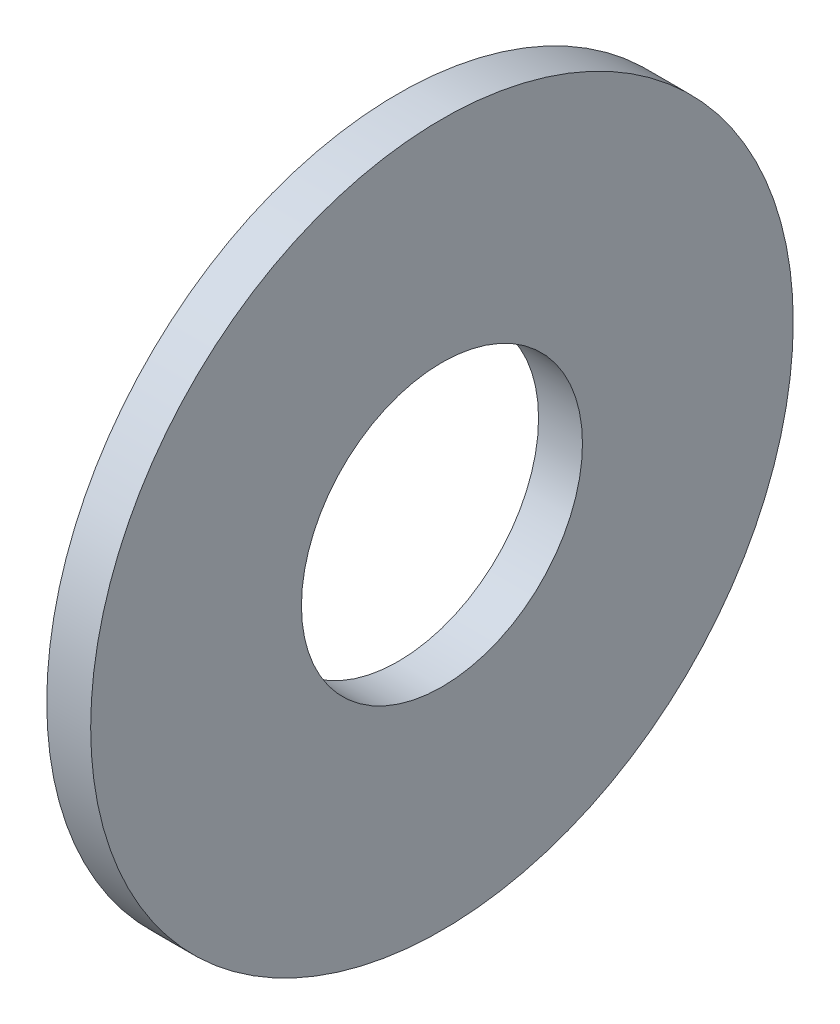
ISO-10303-21;
HEADER;
FILE_DESCRIPTION(('STEP AP214'),'2;1');
FILE_NAME('part.step','',(''),(''),'','','');
FILE_SCHEMA(('AUTOMOTIVE_DESIGN { 1 0 10303 214 1 1 1 1 }'));
ENDSEC;
DATA;
#1=APPLICATION_CONTEXT('core data for automotive mechanical design processes');
#2=APPLICATION_PROTOCOL_DEFINITION('international standard','automotive_design',2000,#1);
#3=PRODUCT_CONTEXT('',#1,'mechanical');
#4=PRODUCT('Part','Part','',(#3));
#5=PRODUCT_RELATED_PRODUCT_CATEGORY('part','',(#4));
#6=PRODUCT_DEFINITION_FORMATION('','',#4);
#7=PRODUCT_DEFINITION_CONTEXT('part definition',#1,'design');
#8=PRODUCT_DEFINITION('design','',#6,#7);
#9=PRODUCT_DEFINITION_SHAPE('','',#8);
#10=(LENGTH_UNIT() NAMED_UNIT(*) SI_UNIT(.MILLI.,.METRE.));
#11=(NAMED_UNIT(*) PLANE_ANGLE_UNIT() SI_UNIT($,.RADIAN.));
#12=(NAMED_UNIT(*) SI_UNIT($,.STERADIAN.) SOLID_ANGLE_UNIT());
#13=UNCERTAINTY_MEASURE_WITH_UNIT(LENGTH_MEASURE(1.E-05),#10,'distance_accuracy_value','');
#14=(GEOMETRIC_REPRESENTATION_CONTEXT(3) GLOBAL_UNCERTAINTY_ASSIGNED_CONTEXT((#13)) GLOBAL_UNIT_ASSIGNED_CONTEXT((#10,
#11,#12)) REPRESENTATION_CONTEXT('',''));
#15=CARTESIAN_POINT('',(0.,0.,0.));
#16=DIRECTION('',(0.,0.,1.));
#17=DIRECTION('',(1.,0.,0.));
#18=AXIS2_PLACEMENT_3D('',#15,#16,#17);
#19=CARTESIAN_POINT('',(0.5,0.,0.));
#20=DIRECTION('',(1.,0.,0.));
#21=DIRECTION('',(0.,0.,-1.));
#22=AXIS2_PLACEMENT_3D('',#19,#20,#21);
#23=PLANE('',#22);
#24=CARTESIAN_POINT('',(0.5,0.,0.));
#25=DIRECTION('',(1.,0.,0.));
#26=DIRECTION('',(0.,0.,-1.));
#27=AXIS2_PLACEMENT_3D('',#24,#25,#26);
#28=CIRCLE('',#27,4.);
#29=CARTESIAN_POINT('',(0.5,0.,-4.));
#30=VERTEX_POINT('',#29);
#31=EDGE_CURVE('E10',#30,#30,#28,.T.);
#32=ORIENTED_EDGE('',*,*,#31,.T.);
#33=EDGE_LOOP('',(#32));
#34=FACE_BOUND('',#33,.T.);
#35=CARTESIAN_POINT('',(0.5,0.,0.));
#36=DIRECTION('',(1.,0.,0.));
#37=DIRECTION('',(0.,0.,-1.));
#38=AXIS2_PLACEMENT_3D('',#35,#36,#37);
#39=CIRCLE('',#38,1.6);
#40=CARTESIAN_POINT('',(0.5,0.,-1.6));
#41=VERTEX_POINT('',#40);
#42=EDGE_CURVE('E39',#41,#41,#39,.T.);
#43=ORIENTED_EDGE('',*,*,#42,.F.);
#44=EDGE_LOOP('',(#43));
#45=FACE_BOUND('',#44,.T.);
#46=ADVANCED_FACE('F28',(#34,#45),#23,.T.);
#47=CARTESIAN_POINT('',(0.,0.,0.));
#48=DIRECTION('',(1.,0.,0.));
#49=DIRECTION('',(0.,0.,-1.));
#50=AXIS2_PLACEMENT_3D('',#47,#48,#49);
#51=PLANE('',#50);
#52=CARTESIAN_POINT('',(0.,0.,0.));
#53=DIRECTION('',(1.,0.,0.));
#54=DIRECTION('',(0.,0.,-1.));
#55=AXIS2_PLACEMENT_3D('',#52,#53,#54);
#56=CIRCLE('',#55,4.);
#57=CARTESIAN_POINT('',(0.,0.,-4.));
#58=VERTEX_POINT('',#57);
#59=EDGE_CURVE('E35',#58,#58,#56,.T.);
#60=ORIENTED_EDGE('',*,*,#59,.F.);
#61=EDGE_LOOP('',(#60));
#62=FACE_BOUND('',#61,.T.);
#63=CARTESIAN_POINT('',(0.,0.,0.));
#64=DIRECTION('',(1.,0.,0.));
#65=DIRECTION('',(0.,0.,-1.));
#66=AXIS2_PLACEMENT_3D('',#63,#64,#65);
#67=CIRCLE('',#66,1.6);
#68=CARTESIAN_POINT('',(0.,0.,-1.6));
#69=VERTEX_POINT('',#68);
#70=EDGE_CURVE('E43',#69,#69,#67,.T.);
#71=ORIENTED_EDGE('',*,*,#70,.T.);
#72=EDGE_LOOP('',(#71));
#73=FACE_BOUND('',#72,.T.);
#74=ADVANCED_FACE('F49',(#62,#73),#51,.F.);
#75=CARTESIAN_POINT('',(0.5,0.,0.));
#76=DIRECTION('',(-1.,0.,0.));
#77=DIRECTION('',(0.,0.,1.));
#78=AXIS2_PLACEMENT_3D('',#75,#76,#77);
#79=CYLINDRICAL_SURFACE('',#78,4.);
#80=ORIENTED_EDGE('',*,*,#31,.F.);
#81=EDGE_LOOP('',(#80));
#82=FACE_BOUND('',#81,.T.);
#83=ORIENTED_EDGE('',*,*,#59,.T.);
#84=EDGE_LOOP('',(#83));
#85=FACE_BOUND('',#84,.T.);
#86=ADVANCED_FACE('F30',(#82,#85),#79,.T.);
#87=CARTESIAN_POINT('',(0.5,0.,0.));
#88=DIRECTION('',(-1.,0.,0.));
#89=DIRECTION('',(0.,0.,1.));
#90=AXIS2_PLACEMENT_3D('',#87,#88,#89);
#91=CYLINDRICAL_SURFACE('',#90,1.6);
#92=ORIENTED_EDGE('',*,*,#42,.T.);
#93=EDGE_LOOP('',(#92));
#94=FACE_BOUND('',#93,.T.);
#95=ORIENTED_EDGE('',*,*,#70,.F.);
#96=EDGE_LOOP('',(#95));
#97=FACE_BOUND('',#96,.T.);
#98=ADVANCED_FACE('F51',(#94,#97),#91,.F.);
#99=CLOSED_SHELL('',(#46,#74,#86,#98));
#100=MANIFOLD_SOLID_BREP('B2',#99);
#101=ADVANCED_BREP_SHAPE_REPRESENTATION('',(#18,#100),#14);
#102=SHAPE_DEFINITION_REPRESENTATION(#9,#101);
ENDSEC;
END-ISO-10303-21;
